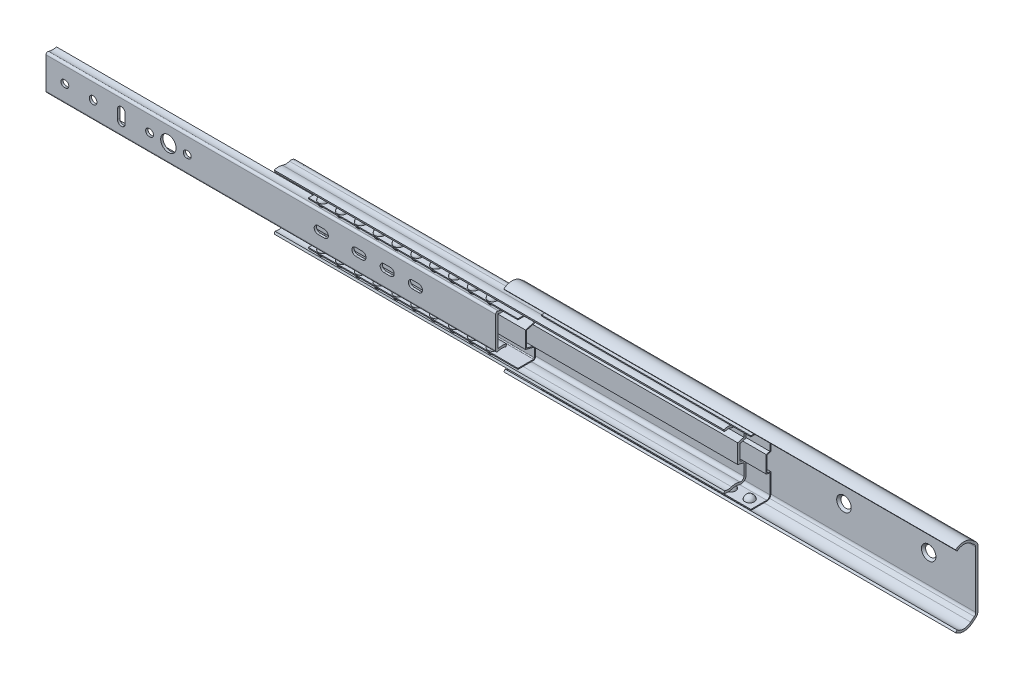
from build123d import *
from build123d.topology import SkipClean

# Parameters (mm, degrees)
EXTRUDE1_DEPTH                               = 152.4
EXTRUDE2_DEPTH                               = 141.2875
EXTRUDE3_DEPTH                               = 303.276
EXTRUDE5_DEPTH                               = 141.2875
EXTRUDE6_DEPTH                               = 303.276
SKETCH5_R                                    = 2.5781
CUT_EXTRUDE1_DEPTH                           = 459.345781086
CSK_FOR_10_FLAT_HEAD_MACHINE_SCREW1_AT_COUNT = 2
CSK_FOR_10_FLAT_HEAD_MACHINE_SCREW1_AT_PITCH = 57.15
CSK_FOR_10_FLAT_HEAD_MACHINE_SCREW1_2_COUNT  = 2
CSK_FOR_10_FLAT_HEAD_MACHINE_SCREW1_2_PITCH  = 184.15
SKETCH6_R                                    = 5.207
SKETCH6_R_2                                  = 2.5781
CUT_EXTRUDE2_DEPTH                           = 459.28496944
LPATTERN2_COUNT                              = 10
LPATTERN2_PITCH                              = 12.7
LPATTERN3_COUNT                              = 10
LPATTERN3_PITCH                              = 12.7


with BuildPart() as part:
    # Sketch1 → Extrude1 (new, symmetric)
    with BuildSketch(Plane(origin=(0, 0, 0), x_dir=(0, 0, -1), z_dir=(1, 0, 0))):
        with BuildLine():
            Line((9.525, -19.05), (9.525, 19.05))
            ThreePointArc((9.525, 19.05), (9.129395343, 20.802803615), (8.019282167, 22.215769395))
            Line((8.019282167, 22.215769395), (5.55625, 24.219290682))
            ThreePointArc((5.55625, 24.219290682), (0, 26.19375), (-5.55625, 24.219290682))
            Line((-5.55625, 24.219290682), (-4.594559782, 23.037035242))
            ThreePointArc((-4.594559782, 23.037035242), (0, 24.66975), (4.594559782, 23.037035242))
            Line((4.594559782, 23.037035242), (7.057591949, 21.033513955))
            ThreePointArc((7.057591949, 21.033513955), (7.75313376, 20.148219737), (8.001, 19.05))
            Line((8.001, 19.05), (8.001, -19.05))
            ThreePointArc((8.001, -19.05), (7.75313376, -20.148219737), (7.057591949, -21.033513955))
            Line((7.057591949, -21.033513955), (4.594559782, -23.037035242))
            ThreePointArc((4.594559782, -23.037035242), (0, -24.66975), (-4.594559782, -23.037035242))
            Line((-4.594559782, -23.037035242), (-5.55625, -24.219290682))
            ThreePointArc((-5.55625, -24.219290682), (0, -26.19375), (5.55625, -24.219290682))
            Line((5.55625, -24.219290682), (8.019282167, -22.215769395))
            ThreePointArc((8.019282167, -22.215769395), (9.129395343, -20.802803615), (9.525, -19.05))
        make_face()
    extrude(amount=EXTRUDE1_DEPTH, both=True)

    # Sketch5 → Cut-Extrude1 (cut, through all)
    with BuildSketch(Plane(origin=(0, 0, -9.525), x_dir=(-1, 0, 0), z_dir=(0, 0, -1))):
        with Locations(Location((146.05, 0, 0), (0, 0, 90))):
            Circle(SKETCH5_R)
        with Locations(Location((120.65, 0, 0), (0, 0, 90))):
            Circle(SKETCH5_R)
    extrude(amount=-CUT_EXTRUDE1_DEPTH, mode=Mode.SUBTRACT)

    # Sketch13 → CSK for _10 Flat Head Machine Screw1 (revolve, cut)
    with BuildSketch(Plane(origin=(120.65, 0, -8.001), x_dir=(0, -1, 0), z_dir=(1, 0, 0))):
        Polygon((0, 0), (0, 1.524), (3.048, 1.524), (3.048, 2.118403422), (4.8895, 0), align=None)
    csk_for_10_flat_head_machine_screw1 = revolve(axis=Axis((120.65, 0, -1.651), (0, 0, -1)), mode=Mode.SUBTRACT)

    # CSK for _10 Flat Head Machine Screw1 at: CSK for _10 Flat Head Machine Screw1 ×2
    with Locations(*[(-i * CSK_FOR_10_FLAT_HEAD_MACHINE_SCREW1_AT_PITCH, 0, 0) for i in range(1, CSK_FOR_10_FLAT_HEAD_MACHINE_SCREW1_AT_COUNT)]):
        add(csk_for_10_flat_head_machine_screw1, mode=Mode.SUBTRACT)

    # CSK for _10 Flat Head Machine Screw1 2: CSK for _10 Flat Head Machine Screw1 ×2
    with Locations(*[(-i * CSK_FOR_10_FLAT_HEAD_MACHINE_SCREW1_2_PITCH, 0, 0) for i in range(1, CSK_FOR_10_FLAT_HEAD_MACHINE_SCREW1_2_COUNT)]):
        add(csk_for_10_flat_head_machine_screw1, mode=Mode.SUBTRACT)


with BuildPart() as body_2:
    # Sketch2 → Extrude2 (new body)
    with BuildSketch(Plane(origin=(14.2875, 0, 0), x_dir=(0, 0, -1), z_dir=(1, 0, 0))):
        with BuildLine():
            Line((7.2136, -19.049204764), (7.2136, -6.35))
            Line((7.2136, -6.35), (4.7625, -5.693229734))
            Line((4.7625, -5.693229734), (4.7625, 0))
            Line((4.7625, 0), (4.7625, 5.693229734))
            Line((4.7625, 5.693229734), (7.2136, 6.35))
            Line((7.2136, 6.35), (7.2136, 19.049204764))
            ThreePointArc((7.2136, 19.049204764), (6.594029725, 20.544979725), (5.098254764, 21.16455))
            Line((5.098254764, 21.16455), (-5.55625, 21.16455))
            Line((-5.55625, 21.16455), (-5.55625, 21.82495))
            Line((-5.55625, 21.82495), (5.098254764, 21.82495))
            ThreePointArc((5.098254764, 21.82495), (7.061003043, 21.011953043), (7.874, 19.049204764))
            Line((7.874, 19.049204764), (7.874, 5.843257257))
            Line((7.874, 5.843257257), (5.4229, 5.186486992))
            Line((5.4229, 5.186486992), (5.4229, 0))
            Line((5.4229, 0), (5.4229, -5.186486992))
            Line((5.4229, -5.186486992), (7.874, -5.843257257))
            Line((7.874, -5.843257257), (7.874, -19.049204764))
            ThreePointArc((7.874, -19.049204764), (7.061003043, -21.011953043), (5.098254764, -21.82495))
            Line((5.098254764, -21.82495), (-5.55625, -21.82495))
            Line((-5.55625, -21.82495), (-5.55625, -21.16455))
            Line((-5.55625, -21.16455), (5.098254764, -21.16455))
            ThreePointArc((5.098254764, -21.16455), (6.594029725, -20.544979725), (7.2136, -19.049204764))
        make_face()
    extrude(amount=-EXTRUDE2_DEPTH)

    # Sketch8 → Revolve1 (revolve)
    with SkipClean():  # the faces are left unmerged after this step: merging them gives an invalid solid
        with BuildSketch(Plane(origin=(7.9375, 0, 0), x_dir=(0, 0, -1), z_dir=(1, 0, 0))):
            with BuildLine():
                Line((-3.175, -21.49475), (3.175, -21.49475))
                ThreePointArc((3.175, -21.49475), (0, -24.66975), (-3.175, -21.49475))
            make_face()
        revolve1 = revolve(axis=Axis((7.9375, -21.49475, 3.175), (0, 0, -1)))

    # LPattern2: Revolve1 ×10
    with SkipClean():  # the faces are left unmerged after this step: merging them gives an invalid solid
        with Locations(*[(-i * LPATTERN2_PITCH, 0, 0) for i in range(1, LPATTERN2_COUNT)]):
            add(revolve1)

    # Mirror2: Revolve1 across plane
    with SkipClean():  # the faces are left unmerged after this step: merging them gives an invalid solid
        add(revolve1.mirror(Plane.ZX))

    # Mirror2 copy 1 sketch → Mirror2 copy 1 (revolve)
    with SkipClean():  # the faces are left unmerged after this step: merging them gives an invalid solid
        with BuildSketch(Plane(origin=(-4.7625, 0, 0), x_dir=(0, 0, -1), z_dir=(1, 0, 0))):
            with BuildLine():
                Line((-3.175, 21.49475), (3.175, 21.49475))
                ThreePointArc((3.175, 21.49475), (0, 24.66975), (-3.175, 21.49475))
            make_face()
        revolve(axis=Axis((-4.7625, 21.49475, 3.175), (0, 0, 1)))

    # Mirror2 copy 2 sketch → Mirror2 copy 2 (revolve)
    with SkipClean():  # the faces are left unmerged after this step: merging them gives an invalid solid
        with BuildSketch(Plane(origin=(-17.4625, 0, 0), x_dir=(0, 0, -1), z_dir=(1, 0, 0))):
            with BuildLine():
                Line((-3.175, 21.49475), (3.175, 21.49475))
                ThreePointArc((3.175, 21.49475), (0, 24.66975), (-3.175, 21.49475))
            make_face()
        revolve(axis=Axis((-17.4625, 21.49475, 3.175), (0, 0, 1)))

    # Mirror2 copy 3 sketch → Mirror2 copy 3 (revolve)
    with SkipClean():  # the faces are left unmerged after this step: merging them gives an invalid solid
        with BuildSketch(Plane(origin=(-30.1625, 0, 0), x_dir=(0, 0, -1), z_dir=(1, 0, 0))):
            with BuildLine():
                Line((-3.175, 21.49475), (3.175, 21.49475))
                ThreePointArc((3.175, 21.49475), (0, 24.66975), (-3.175, 21.49475))
            make_face()
        revolve(axis=Axis((-30.1625, 21.49475, 3.175), (0, 0, 1)))

    # Mirror2 copy 4 sketch → Mirror2 copy 4 (revolve)
    with SkipClean():  # the faces are left unmerged after this step: merging them gives an invalid solid
        with BuildSketch(Plane(origin=(-42.8625, 0, 0), x_dir=(0, 0, -1), z_dir=(1, 0, 0))):
            with BuildLine():
                Line((-3.175, 21.49475), (3.175, 21.49475))
                ThreePointArc((3.175, 21.49475), (0, 24.66975), (-3.175, 21.49475))
            make_face()
        revolve(axis=Axis((-42.8625, 21.49475, 3.175), (0, 0, 1)))

    # Mirror2 copy 5 sketch → Mirror2 copy 5 (revolve)
    with SkipClean():  # the faces are left unmerged after this step: merging them gives an invalid solid
        with BuildSketch(Plane(origin=(-55.5625, 0, 0), x_dir=(0, 0, -1), z_dir=(1, 0, 0))):
            with BuildLine():
                Line((-3.175, 21.49475), (3.175, 21.49475))
                ThreePointArc((3.175, 21.49475), (0, 24.66975), (-3.175, 21.49475))
            make_face()
        revolve(axis=Axis((-55.5625, 21.49475, 3.175), (0, 0, 1)))

    # Mirror2 copy 6 sketch → Mirror2 copy 6 (revolve)
    with SkipClean():  # the faces are left unmerged after this step: merging them gives an invalid solid
        with BuildSketch(Plane(origin=(-68.2625, 0, 0), x_dir=(0, 0, -1), z_dir=(1, 0, 0))):
            with BuildLine():
                Line((-3.175, 21.49475), (3.175, 21.49475))
                ThreePointArc((3.175, 21.49475), (0, 24.66975), (-3.175, 21.49475))
            make_face()
        revolve(axis=Axis((-68.2625, 21.49475, 3.175), (0, 0, 1)))

    # Mirror2 copy 7 sketch → Mirror2 copy 7 (revolve)
    with SkipClean():  # the faces are left unmerged after this step: merging them gives an invalid solid
        with BuildSketch(Plane(origin=(-80.9625, 0, 0), x_dir=(0, 0, -1), z_dir=(1, 0, 0))):
            with BuildLine():
                Line((-3.175, 21.49475), (3.175, 21.49475))
                ThreePointArc((3.175, 21.49475), (0, 24.66975), (-3.175, 21.49475))
            make_face()
        revolve(axis=Axis((-80.9625, 21.49475, 3.175), (0, 0, 1)))

    # Mirror2 copy 8 sketch → Mirror2 copy 8 (revolve)
    with SkipClean():  # the faces are left unmerged after this step: merging them gives an invalid solid
        with BuildSketch(Plane(origin=(-93.6625, 0, 0), x_dir=(0, 0, -1), z_dir=(1, 0, 0))):
            with BuildLine():
                Line((-3.175, 21.49475), (3.175, 21.49475))
                ThreePointArc((3.175, 21.49475), (0, 24.66975), (-3.175, 21.49475))
            make_face()
        revolve(axis=Axis((-93.6625, 21.49475, 3.175), (0, 0, 1)))

    # Mirror2 copy 9 sketch → Mirror2 copy 9 (revolve)
    with SkipClean():  # the faces are left unmerged after this step: merging them gives an invalid solid
        with BuildSketch(Plane(origin=(-106.3625, 0, 0), x_dir=(0, 0, -1), z_dir=(1, 0, 0))):
            with BuildLine():
                Line((-3.175, 21.49475), (3.175, 21.49475))
                ThreePointArc((3.175, 21.49475), (0, 24.66975), (-3.175, 21.49475))
            make_face()
        revolve(axis=Axis((-106.3625, 21.49475, 3.175), (0, 0, 1)))


with BuildPart() as body_3:
    # Sketch3 → Extrude3 (new body)
    with BuildSketch(Plane.ZY.offset(304.8)):
        with BuildLine():
            Line((8.001, -18.706154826), (7.511125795, -17.263033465))
            ThreePointArc((7.511125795, -17.263033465), (5.170708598, -17.649438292), (2.830291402, -17.263033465))
            ThreePointArc((2.830291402, -17.263033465), (0, -16.79575), (-2.830291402, -17.263033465))
            ThreePointArc((-2.830291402, -17.263033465), (-4.699299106, -16.985792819), (-5.5626, -15.305089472))
            Line((-5.5626, -15.305089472), (-5.5626, -7.485376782))
            Line((-5.5626, -7.485376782), (-1.347310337, -6.355893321))
            Line((-1.347310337, -6.355893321), (-1.347310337, 6.355893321))
            Line((-1.347310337, 6.355893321), (-5.5626, 7.485376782))
            Line((-5.5626, 7.485376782), (-5.5626, 15.305089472))
            ThreePointArc((-5.5626, 15.305089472), (-4.699299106, 16.985792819), (-2.830291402, 17.263033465))
            ThreePointArc((-2.830291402, 17.263033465), (0, 16.79575), (2.830291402, 17.263033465))
            ThreePointArc((2.830291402, 17.263033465), (5.170708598, 17.649438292), (7.511125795, 17.263033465))
            Line((7.511125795, 17.263033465), (8.001, 18.706154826))
            ThreePointArc((8.001, 18.706154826), (5.170708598, 19.173438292), (2.340417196, 18.706154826))
            ThreePointArc((2.340417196, 18.706154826), (0, 18.31975), (-2.340417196, 18.706154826))
            ThreePointArc((-2.340417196, 18.706154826), (-5.586994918, 18.224571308), (-7.0866, 15.305089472))
            Line((-7.0866, 15.305089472), (-7.0866, 6.315970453))
            Line((-7.0866, 6.315970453), (-2.871310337, 5.186486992))
            Line((-2.871310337, 5.186486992), (-2.871310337, -5.186486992))
            Line((-2.871310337, -5.186486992), (-7.0866, -6.315970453))
            Line((-7.0866, -6.315970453), (-7.0866, -15.305089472))
            ThreePointArc((-7.0866, -15.305089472), (-5.586994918, -18.224571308), (-2.340417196, -18.706154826))
            ThreePointArc((-2.340417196, -18.706154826), (0, -18.31975), (2.340417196, -18.706154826))
            ThreePointArc((2.340417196, -18.706154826), (5.170708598, -19.173438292), (8.001, -18.706154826))
        make_face()
    extrude(amount=-EXTRUDE3_DEPTH)


with BuildPart() as body_4:
    # Sketch9 → Extrude5 (new body)
    with BuildSketch(Plane.ZY.offset(139.6365)):
        with BuildLine():
            Line((8.763, -14.144238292), (-1.7526, -14.144238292))
            ThreePointArc((-1.7526, -14.144238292), (-2.183652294, -13.965690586), (-2.3622, -13.534638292))
            Line((-2.3622, -13.534638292), (-2.3622, -7.311528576))
            Line((-2.3622, -7.311528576), (3.6773735, -5.693229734))
            Line((3.6773735, -5.693229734), (3.6773735, 5.693229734))
            Line((3.6773735, 5.693229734), (-2.3622, 7.311528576))
            Line((-2.3622, 7.311528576), (-2.3622, 13.534638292))
            ThreePointArc((-2.3622, 13.534638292), (-2.183652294, 13.965690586), (-1.7526, 14.144238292))
            Line((-1.7526, 14.144238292), (8.763, 14.144238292))
            Line((8.763, 14.144238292), (8.763, 14.804638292))
            Line((8.763, 14.804638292), (-1.7526, 14.804638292))
            ThreePointArc((-1.7526, 14.804638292), (-2.650625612, 14.432663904), (-3.0226, 13.534638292))
            Line((-3.0226, 13.534638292), (-3.0226, 6.804785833))
            Line((-3.0226, 6.804785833), (3.0169735, 5.186486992))
            Line((3.0169735, 5.186486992), (3.0169735, -5.186486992))
            Line((3.0169735, -5.186486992), (-3.0226, -6.804785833))
            Line((-3.0226, -6.804785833), (-3.0226, -13.534638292))
            ThreePointArc((-3.0226, -13.534638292), (-2.650625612, -14.432663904), (-1.7526, -14.804638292))
            Line((-1.7526, -14.804638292), (8.763, -14.804638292))
            Line((8.763, -14.804638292), (8.763, -14.144238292))
        make_face()
    extrude(amount=EXTRUDE5_DEPTH)

    # Sketch12 → Revolve2 (revolve)
    with SkipClean():  # the faces are left unmerged after this step: merging them gives an invalid solid
        with BuildSketch(Plane.ZY.offset(274.574)):
            with BuildLine():
                Line((8.345708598, -14.474438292), (1.995708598, -14.474438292))
                ThreePointArc((1.995708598, -14.474438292), (5.170708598, -11.299438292), (8.345708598, -14.474438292))
            make_face()
        revolve2 = revolve(axis=Axis((-274.574, -14.474438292, 8.345708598), (0, 0, -1)))

    # LPattern3: Revolve2 ×10
    with SkipClean():  # the faces are left unmerged after this step: merging them gives an invalid solid
        with Locations(*[(i * LPATTERN3_PITCH, 0, 0) for i in range(1, LPATTERN3_COUNT)]):
            add(revolve2)

    # Mirror3: Revolve2 across plane
    with SkipClean():  # the faces are left unmerged after this step: merging them gives an invalid solid
        add(revolve2.mirror(Plane.ZX))

    # Mirror3 copy 1 sketch → Mirror3 copy 1 (revolve)
    with SkipClean():  # the faces are left unmerged after this step: merging them gives an invalid solid
        with BuildSketch(Plane.ZY.offset(261.874)):
            with BuildLine():
                Line((8.345708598, 14.474438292), (1.995708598, 14.474438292))
                ThreePointArc((1.995708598, 14.474438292), (5.170708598, 11.299438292), (8.345708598, 14.474438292))
            make_face()
        revolve(axis=Axis((-261.874, 14.474438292, 8.345708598), (0, 0, 1)))

    # Mirror3 copy 2 sketch → Mirror3 copy 2 (revolve)
    with SkipClean():  # the faces are left unmerged after this step: merging them gives an invalid solid
        with BuildSketch(Plane.ZY.offset(249.174)):
            with BuildLine():
                Line((8.345708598, 14.474438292), (1.995708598, 14.474438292))
                ThreePointArc((1.995708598, 14.474438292), (5.170708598, 11.299438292), (8.345708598, 14.474438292))
            make_face()
        revolve(axis=Axis((-249.174, 14.474438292, 8.345708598), (0, 0, 1)))

    # Mirror3 copy 3 sketch → Mirror3 copy 3 (revolve)
    with SkipClean():  # the faces are left unmerged after this step: merging them gives an invalid solid
        with BuildSketch(Plane.ZY.offset(236.474)):
            with BuildLine():
                Line((8.345708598, 14.474438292), (1.995708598, 14.474438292))
                ThreePointArc((1.995708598, 14.474438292), (5.170708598, 11.299438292), (8.345708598, 14.474438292))
            make_face()
        revolve(axis=Axis((-236.474, 14.474438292, 8.345708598), (0, 0, 1)))

    # Mirror3 copy 4 sketch → Mirror3 copy 4 (revolve)
    with SkipClean():  # the faces are left unmerged after this step: merging them gives an invalid solid
        with BuildSketch(Plane.ZY.offset(223.774)):
            with BuildLine():
                Line((8.345708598, 14.474438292), (1.995708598, 14.474438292))
                ThreePointArc((1.995708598, 14.474438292), (5.170708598, 11.299438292), (8.345708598, 14.474438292))
            make_face()
        revolve(axis=Axis((-223.774, 14.474438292, 8.345708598), (0, 0, 1)))

    # Mirror3 copy 5 sketch → Mirror3 copy 5 (revolve)
    with SkipClean():  # the faces are left unmerged after this step: merging them gives an invalid solid
        with BuildSketch(Plane.ZY.offset(211.074)):
            with BuildLine():
                Line((8.345708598, 14.474438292), (1.995708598, 14.474438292))
                ThreePointArc((1.995708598, 14.474438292), (5.170708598, 11.299438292), (8.345708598, 14.474438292))
            make_face()
        revolve(axis=Axis((-211.074, 14.474438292, 8.345708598), (0, 0, 1)))

    # Mirror3 copy 6 sketch → Mirror3 copy 6 (revolve)
    with SkipClean():  # the faces are left unmerged after this step: merging them gives an invalid solid
        with BuildSketch(Plane.ZY.offset(198.374)):
            with BuildLine():
                Line((8.345708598, 14.474438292), (1.995708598, 14.474438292))
                ThreePointArc((1.995708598, 14.474438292), (5.170708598, 11.299438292), (8.345708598, 14.474438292))
            make_face()
        revolve(axis=Axis((-198.374, 14.474438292, 8.345708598), (0, 0, 1)))

    # Mirror3 copy 7 sketch → Mirror3 copy 7 (revolve)
    with SkipClean():  # the faces are left unmerged after this step: merging them gives an invalid solid
        with BuildSketch(Plane.ZY.offset(185.674)):
            with BuildLine():
                Line((8.345708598, 14.474438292), (1.995708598, 14.474438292))
                ThreePointArc((1.995708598, 14.474438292), (5.170708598, 11.299438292), (8.345708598, 14.474438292))
            make_face()
        revolve(axis=Axis((-185.674, 14.474438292, 8.345708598), (0, 0, 1)))

    # Mirror3 copy 8 sketch → Mirror3 copy 8 (revolve)
    with SkipClean():  # the faces are left unmerged after this step: merging them gives an invalid solid
        with BuildSketch(Plane.ZY.offset(172.974)):
            with BuildLine():
                Line((8.345708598, 14.474438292), (1.995708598, 14.474438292))
                ThreePointArc((1.995708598, 14.474438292), (5.170708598, 11.299438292), (8.345708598, 14.474438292))
            make_face()
        revolve(axis=Axis((-172.974, 14.474438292, 8.345708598), (0, 0, 1)))

    # Mirror3 copy 9 sketch → Mirror3 copy 9 (revolve)
    with SkipClean():  # the faces are left unmerged after this step: merging them gives an invalid solid
        with BuildSketch(Plane.ZY.offset(160.274)):
            with BuildLine():
                Line((8.345708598, 14.474438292), (1.995708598, 14.474438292))
                ThreePointArc((1.995708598, 14.474438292), (5.170708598, 11.299438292), (8.345708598, 14.474438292))
            make_face()
        revolve(axis=Axis((-160.274, 14.474438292, 8.345708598), (0, 0, 1)))


with BuildPart() as body_5:
    # Sketch10 → Extrude6 (new body)
    with BuildSketch(Plane(origin=(-457.2, 0, 0), x_dir=(0, 0, -1), z_dir=(1, 0, 0))):
        with BuildLine():
            Line((-9.525, -10.605051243), (-9.525, 10.605051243))
            ThreePointArc((-9.525, 10.605051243), (-8.973032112, 11.65258639), (-7.796921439, 11.789561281))
            ThreePointArc((-7.796921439, 11.789561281), (-5.170708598, 11.299438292), (-2.544495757, 11.789561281))
            Line((-2.544495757, 11.789561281), (-1.994801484, 10.368149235))
            ThreePointArc((-1.994801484, 10.368149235), (-4.986872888, 9.777357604), (-8.001, 10.242721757))
            Line((-8.001, 10.242721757), (-8.001, -10.242721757))
            ThreePointArc((-8.001, -10.242721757), (-4.986872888, -9.777357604), (-1.994801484, -10.368149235))
            Line((-1.994801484, -10.368149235), (-2.544495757, -11.789561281))
            ThreePointArc((-2.544495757, -11.789561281), (-5.170708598, -11.299438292), (-7.796921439, -11.789561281))
            ThreePointArc((-7.796921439, -11.789561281), (-8.973032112, -11.65258639), (-9.525, -10.605051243))
        make_face()
    extrude(amount=EXTRUDE6_DEPTH)

    # Sketch6 → Cut-Extrude2 (cut, through all)
    with BuildSketch(Plane(origin=(0, 0, 8.001), x_dir=(-1, 0, 0), z_dir=(0, 0, -1))):
        with Locations(Location((374.65, 0, 0), (0, 0, 90))):
            Circle(SKETCH6_R)
        with Locations(Location((425.45, 0, 0), (0, 0, 90))):
            Circle(SKETCH6_R_2)
        with BuildLine():
            Line((387.731, -2.286), (386.969, -2.286))
            ThreePointArc((386.969, -2.286), (384.683, 0), (386.969, 2.286))
            Line((386.969, 2.286), (387.731, 2.286))
            ThreePointArc((387.731, 2.286), (390.017, 0), (387.731, -2.286))
        make_face()
        with BuildLine():
            Line((273.709553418, -2.578946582), (269.342446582, -2.578946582))
            ThreePointArc((269.342446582, -2.578946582), (266.7635, 0), (269.342446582, 2.578946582))
            Line((269.342446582, 2.578946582), (273.709553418, 2.578946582))
            ThreePointArc((273.709553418, 2.578946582), (276.2885, 0), (273.709553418, -2.578946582))
        make_face()
        with BuildLine():
            Line((248.309553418, -2.578946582), (243.942446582, -2.578946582))
            ThreePointArc((243.942446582, -2.578946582), (241.3635, 0), (243.942446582, 2.578946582))
            Line((243.942446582, 2.578946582), (248.309553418, 2.578946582))
            ThreePointArc((248.309553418, 2.578946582), (250.8885, 0), (248.309553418, -2.578946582))
        make_face()
        with BuildLine():
            Line((444.881, -2.286), (444.119, -2.286))
            ThreePointArc((444.119, -2.286), (441.833, 0), (444.119, 2.286))
            Line((444.119, 2.286), (444.881, 2.286))
            ThreePointArc((444.881, 2.286), (447.167, 0), (444.881, -2.286))
        make_face()
        with BuildLine():
            Line((229.259553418, -2.578946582), (224.892446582, -2.578946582))
            ThreePointArc((224.892446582, -2.578946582), (222.3135, 0), (224.892446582, 2.578946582))
            Line((224.892446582, 2.578946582), (229.259553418, 2.578946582))
            ThreePointArc((229.259553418, 2.578946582), (231.8385, 0), (229.259553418, -2.578946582))
        make_face()
        with BuildLine():
            Line((362.331, -2.286), (361.569, -2.286))
            ThreePointArc((361.569, -2.286), (359.283, 0), (361.569, 2.286))
            Line((361.569, 2.286), (362.331, 2.286))
            ThreePointArc((362.331, 2.286), (364.617, 0), (362.331, -2.286))
        make_face()
        with BuildLine():
            Line((408.9781, -3.175), (408.9781, 3.175))
            ThreePointArc((408.9781, 3.175), (406.4, 5.7531), (403.8219, 3.175))
            Line((403.8219, 3.175), (403.8219, -3.175))
            ThreePointArc((403.8219, -3.175), (406.4, -5.7531), (408.9781, -3.175))
        make_face()
        with BuildLine():
            Line((210.209553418, -2.578946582), (205.842446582, -2.578946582))
            ThreePointArc((205.842446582, -2.578946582), (203.2635, 0), (205.842446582, 2.578946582))
            Line((205.842446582, 2.578946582), (210.209553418, 2.578946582))
            ThreePointArc((210.209553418, 2.578946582), (212.7885, 0), (210.209553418, -2.578946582))
        make_face()
    extrude(amount=-CUT_EXTRUDE2_DEPTH, mode=Mode.SUBTRACT)


solid = Compound([part.part, body_2.part, body_3.part, body_4.part, body_5.part])
